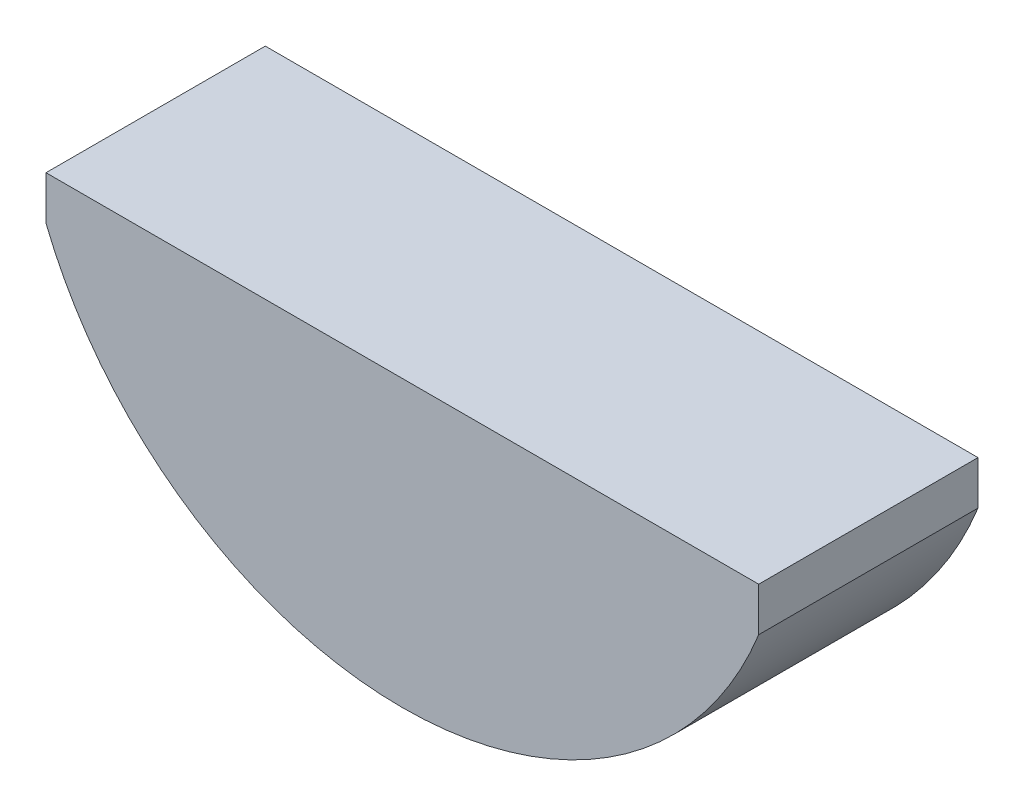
from build123d import *

# Parameters (mm, degrees)
BASE_EXTRUSION_DEPTH = 1


with BuildPart() as part:
    # Esquisse1 → Base-Extrusion (new, symmetric)
    with BuildSketch(Plane.XY):
        with BuildLine():
            Line((-3.25, -1.299038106), (-3.25, -0.9))
            Line((-3.25, -0.9), (3.25, -0.9))
            Line((3.25, -0.9), (3.25, -1.299038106))
            ThreePointArc((3.25, -1.299038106), (0, -3.5), (-3.25, -1.299038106))
        make_face()
    extrude(amount=BASE_EXTRUSION_DEPTH, both=True)


solid = part.part
